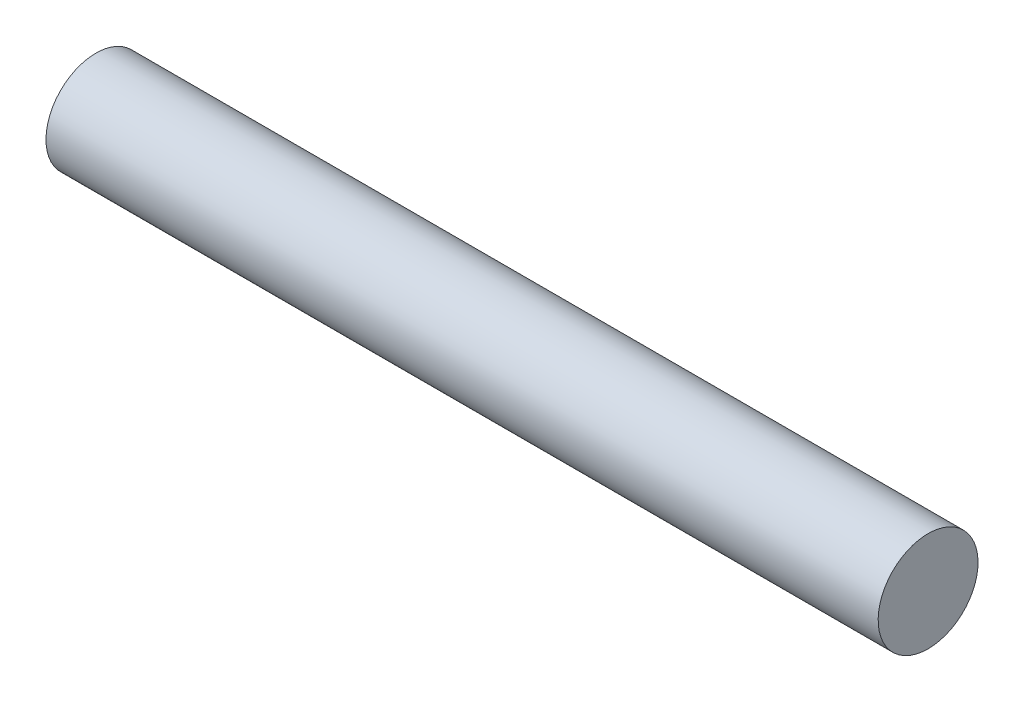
from build123d import *

# Parameters (mm, degrees)
ESQUISSE1_W = 25
ESQUISSE1_H = 1.5


with BuildPart() as part:
    # Esquisse1 → Base-R_volution (revolve)
    with BuildSketch(Plane.XY, mode=Mode.PRIVATE) as base_r_volution_sk:
        with Locations((12.5, 0.75)):
            Rectangle(ESQUISSE1_W, ESQUISSE1_H)
    revolve(base_r_volution_sk.sketch.rotate(Axis((0, 0, 0), (1, 0, 0)), 180), axis=Axis((0, 0, 0), (1, 0, 0)))


solid = part.part
